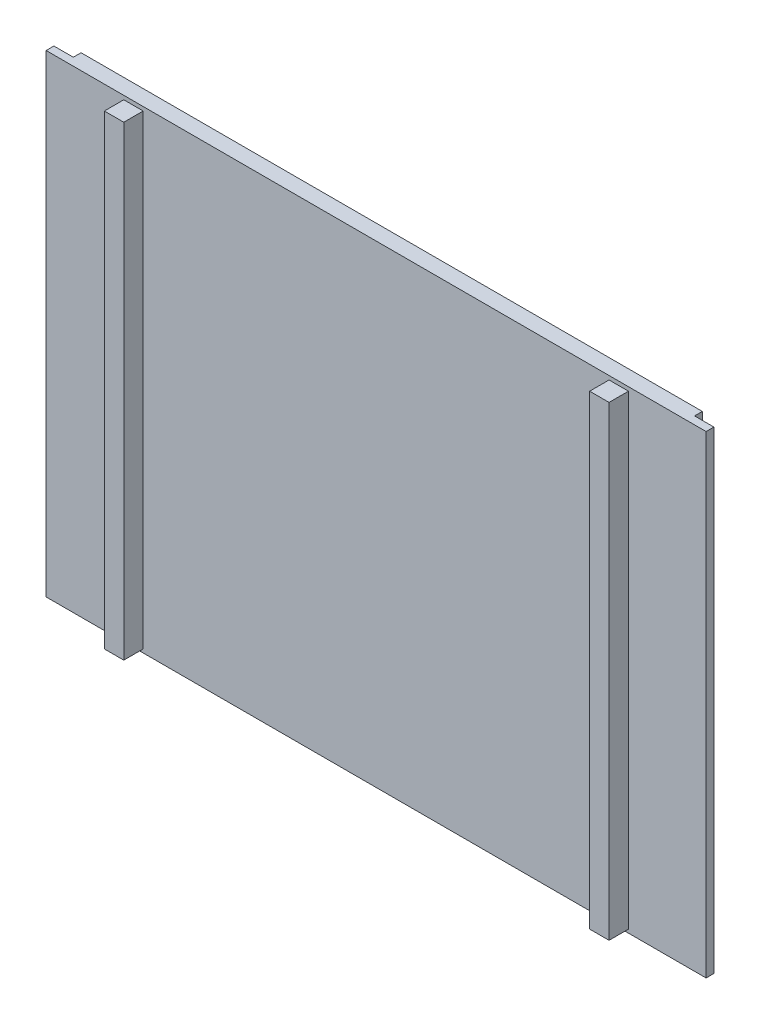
from build123d import *

# Parameters (mm, degrees)
CROQUIS1_W              = 850
CROQUIS1_H              = 609.5
SALIENTE_EXTRUIR1_DEPTH = 10
CROQUIS2_W              = 800.16
CROQUIS2_H              = 604.51
CROQUIS2_W_2            = 790.16
CROQUIS2_H_2            = 594.51
SALIENTE_EXTRUIR2_DEPTH = 10
CROQUIS8_W              = 25
CROQUIS8_H              = 600
SALIENTE_EXTRUIR6_DEPTH = 25


with BuildPart() as part:
    # Croquis1 → Saliente-Extruir1 (new body)
    with BuildSketch(Plane.XY):
        with Locations((425, 304.75)):
            Rectangle(CROQUIS1_W, CROQUIS1_H)
    extrude(amount=SALIENTE_EXTRUIR1_DEPTH)

    # Croquis2 → Saliente-Extruir2 (add)
    with BuildSketch(Plane(origin=(0, 0, 0), x_dir=(-1, 0, 0), z_dir=(0, 0, -1))):
        with Locations((-425.08, 307.245)):
            Rectangle(CROQUIS2_W, CROQUIS2_H)
        with Locations((-425.08, 307.245)):
            Rectangle(CROQUIS2_W_2, CROQUIS2_H_2, mode=Mode.SUBTRACT)
    extrude(amount=SALIENTE_EXTRUIR2_DEPTH)

    # Croquis8 → Saliente-Extruir6 (add)
    with BuildSketch(Plane.XY.offset(10)):
        with Locations((112.5, 304.5)):
            Rectangle(CROQUIS8_W, CROQUIS8_H)
        with Locations((737.5, 304.5)):
            Rectangle(CROQUIS8_W, CROQUIS8_H)
    extrude(amount=SALIENTE_EXTRUIR6_DEPTH)


solid = part.part
